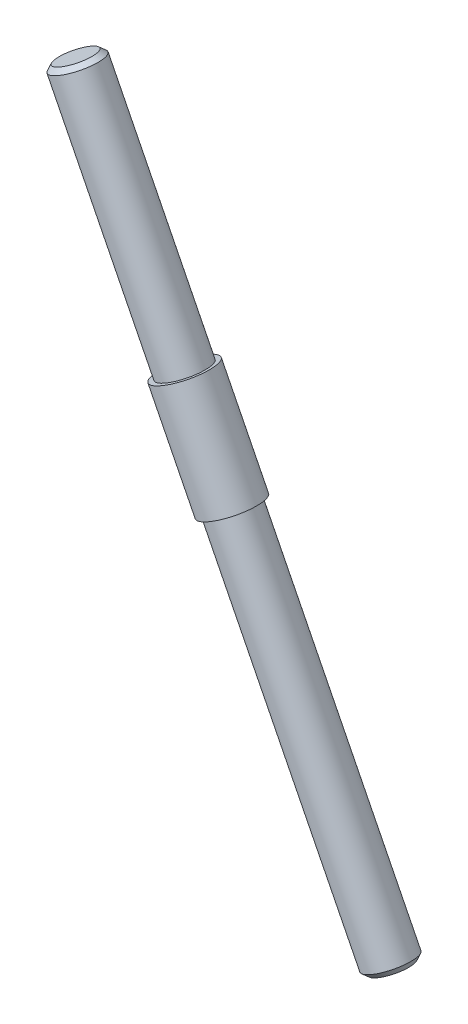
from build123d import *

# Parameters (mm, degrees)
CHANFREIN1_SIZE = 0.5


with BuildPart() as part:
    # Esquisse1 → R_volution1 (revolve)
    with BuildSketch(Plane.XY):
        Polygon((-21.570007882, 119.849102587), (-19.336650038, 120.972540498), (-7.428208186, 97.298947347), (-6.981536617, 97.523634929), (-1.813722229, 87.250188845), (-2.260393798, 87.025501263), (15.265237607, 52.18511889), (13.031879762, 51.06168098), align=None)
    revolve(axis=Axis((-16.402193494, 109.575656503, 0), (-0.4493751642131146, 0.8933431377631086, 0)))

    # Chanfrein1
    chanfrein1_edges = [part.edges().sort_by_distance(p)[0] for p in [
        (-23.803365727, 118.725664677, 0),
        (10.798521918, 49.938243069, 0),
    ]]
    chamfer(chanfrein1_edges, length=CHANFREIN1_SIZE)


solid = part.part
